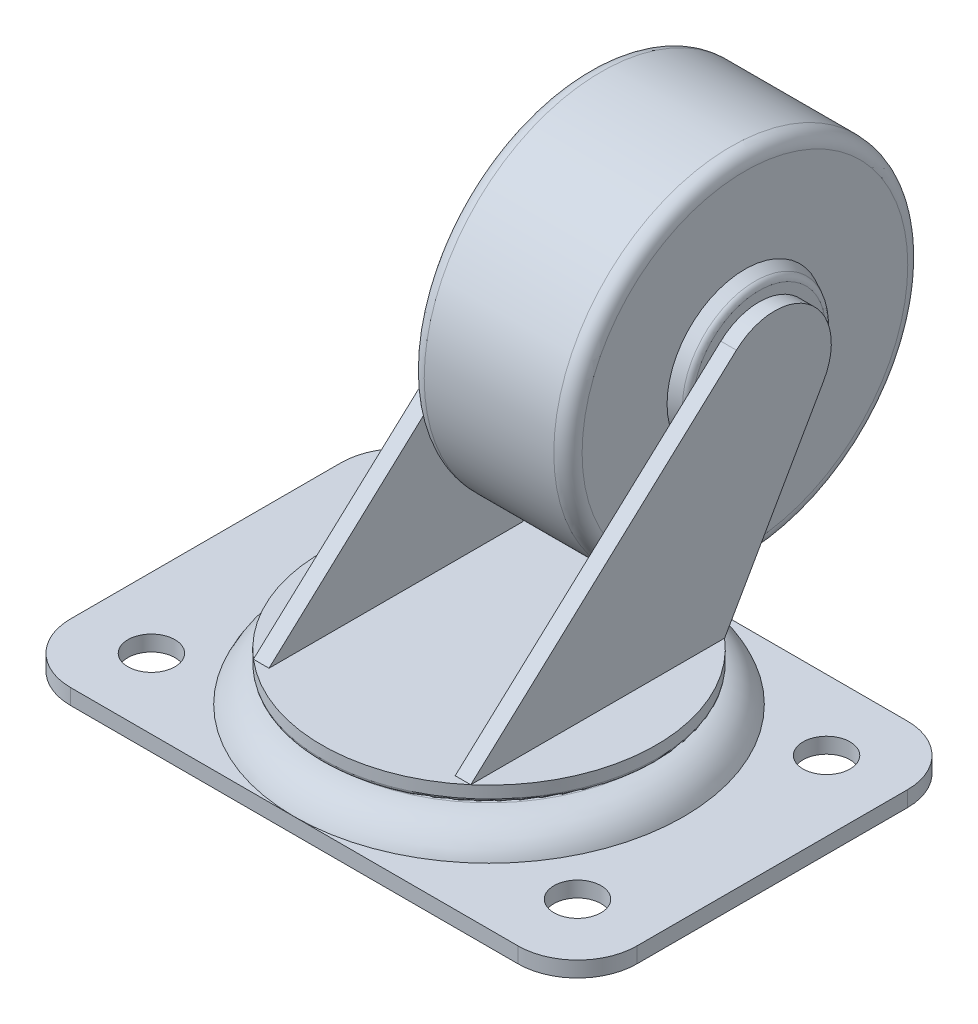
ISO-10303-21;
HEADER;
FILE_DESCRIPTION(('STEP AP214'),'2;1');
FILE_NAME('part.step','',(''),(''),'','','');
FILE_SCHEMA(('AUTOMOTIVE_DESIGN { 1 0 10303 214 1 1 1 1 }'));
ENDSEC;
DATA;
#1=APPLICATION_CONTEXT('core data for automotive mechanical design processes');
#2=APPLICATION_PROTOCOL_DEFINITION('international standard','automotive_design',2000,#1);
#3=PRODUCT_CONTEXT('',#1,'mechanical');
#4=PRODUCT('Part','Part','',(#3));
#5=PRODUCT_RELATED_PRODUCT_CATEGORY('part','',(#4));
#6=PRODUCT_DEFINITION_FORMATION('','',#4);
#7=PRODUCT_DEFINITION_CONTEXT('part definition',#1,'design');
#8=PRODUCT_DEFINITION('design','',#6,#7);
#9=PRODUCT_DEFINITION_SHAPE('','',#8);
#10=(LENGTH_UNIT() NAMED_UNIT(*) SI_UNIT(.MILLI.,.METRE.));
#11=(NAMED_UNIT(*) PLANE_ANGLE_UNIT() SI_UNIT($,.RADIAN.));
#12=(NAMED_UNIT(*) SI_UNIT($,.STERADIAN.) SOLID_ANGLE_UNIT());
#13=UNCERTAINTY_MEASURE_WITH_UNIT(LENGTH_MEASURE(1.E-05),#10,'distance_accuracy_value','');
#14=(GEOMETRIC_REPRESENTATION_CONTEXT(3) GLOBAL_UNCERTAINTY_ASSIGNED_CONTEXT((#13)) GLOBAL_UNIT_ASSIGNED_CONTEXT((#10,
#11,#12)) REPRESENTATION_CONTEXT('',''));
#15=CARTESIAN_POINT('',(0.,0.,0.));
#16=DIRECTION('',(0.,0.,1.));
#17=DIRECTION('',(1.,0.,0.));
#18=AXIS2_PLACEMENT_3D('',#15,#16,#17);
#19=CARTESIAN_POINT('',(16.7004999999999,47.625,-31.7500000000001));
#20=DIRECTION('',(-1.,0.,0.));
#21=DIRECTION('',(0.,0.,1.));
#22=AXIS2_PLACEMENT_3D('',#19,#20,#21);
#23=PLANE('',#22);
#24=DIRECTION('',(0.,0.675765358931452,-0.737116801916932));
#25=VECTOR('',#24,1.);
#26=CARTESIAN_POINT('',(16.7004999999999,55.114106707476,-24.8842239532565));
#27=LINE('',#26,#25);
#28=CARTESIAN_POINT('',(16.7005000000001,11.43,22.7658791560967));
#29=VERTEX_POINT('',#28);
#30=CARTESIAN_POINT('',(16.7004999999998,50.9078306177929,-20.296068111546));
#31=VERTEX_POINT('',#30);
#32=EDGE_CURVE('E244',#29,#31,#27,.T.);
#33=ORIENTED_EDGE('',*,*,#32,.T.);
#34=CARTESIAN_POINT('',(16.7004999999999,47.625,-31.7499999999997));
#35=DIRECTION('',(-1.,0.,0.));
#36=DIRECTION('',(0.,0.,1.));
#37=AXIS2_PLACEMENT_3D('',#34,#35,#36);
#38=CIRCLE('',#37,11.9150968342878);
#39=CARTESIAN_POINT('',(16.7004999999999,37.1794578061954,-37.4823800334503));
#40=VERTEX_POINT('',#39);
#41=EDGE_CURVE('E189',#31,#40,#38,.F.);
#42=ORIENTED_EDGE('',*,*,#41,.T.);
#43=DIRECTION('',(0.,-0.86820646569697,0.496203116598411));
#44=VECTOR('',#43,1.);
#45=CARTESIAN_POINT('',(16.7004999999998,42.5835763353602,-40.570977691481));
#46=LINE('',#45,#44);
#47=CARTESIAN_POINT('',(16.7004999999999,11.43,-22.7658791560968));
#48=VERTEX_POINT('',#47);
#49=EDGE_CURVE('E237',#40,#48,#46,.T.);
#50=ORIENTED_EDGE('',*,*,#49,.T.);
#51=DIRECTION('',(0.,0.,1.));
#52=VECTOR('',#51,1.);
#53=CARTESIAN_POINT('',(16.7005000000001,11.43,22.7658791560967));
#54=LINE('',#53,#52);
#55=EDGE_CURVE('E241',#48,#29,#54,.T.);
#56=ORIENTED_EDGE('',*,*,#55,.T.);
#57=EDGE_LOOP('',(#33,#42,#50,#56));
#58=FACE_BOUND('',#57,.T.);
#59=ADVANCED_FACE('F36',(#58),#23,.T.);
#60=CARTESIAN_POINT('',(-29.972,11.43,0.));
#61=DIRECTION('',(0.,1.,0.));
#62=DIRECTION('',(-1.,0.,0.));
#63=AXIS2_PLACEMENT_3D('',#60,#61,#62);
#64=PLANE('',#63);
#65=CARTESIAN_POINT('',(0.,11.43,0.));
#66=DIRECTION('',(0.,1.,0.));
#67=DIRECTION('',(-1.,0.,0.));
#68=AXIS2_PLACEMENT_3D('',#65,#66,#67);
#69=CIRCLE('',#68,29.972);
#70=CARTESIAN_POINT('',(-19.4945000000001,11.43,-22.7658791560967));
#71=VERTEX_POINT('',#70);
#72=CARTESIAN_POINT('',(-19.4944999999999,11.43,22.7658791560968));
#73=VERTEX_POINT('',#72);
#74=EDGE_CURVE('E576',#71,#73,#69,.T.);
#75=ORIENTED_EDGE('',*,*,#74,.T.);
#76=DIRECTION('',(0.,0.,1.));
#77=VECTOR('',#76,1.);
#78=CARTESIAN_POINT('',(-19.4944999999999,11.43,22.7658791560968));
#79=LINE('',#78,#77);
#80=EDGE_CURVE('E222',#71,#73,#79,.T.);
#81=ORIENTED_EDGE('',*,*,#80,.F.);
#82=EDGE_LOOP('',(#75,#81));
#83=FACE_BOUND('',#82,.T.);
#84=ADVANCED_FACE('F400',(#83),#64,.T.);
#85=CARTESIAN_POINT('',(19.4945000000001,11.43,22.7658791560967));
#86=VERTEX_POINT('',#85);
#87=CARTESIAN_POINT('',(19.4944999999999,11.43,-22.7658791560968));
#88=VERTEX_POINT('',#87);
#89=EDGE_CURVE('E269',#86,#88,#69,.T.);
#90=ORIENTED_EDGE('',*,*,#89,.T.);
#91=DIRECTION('',(0.,0.,1.));
#92=VECTOR('',#91,1.);
#93=CARTESIAN_POINT('',(19.4945000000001,11.43,22.7658791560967));
#94=LINE('',#93,#92);
#95=EDGE_CURVE('E253',#88,#86,#94,.T.);
#96=ORIENTED_EDGE('',*,*,#95,.T.);
#97=EDGE_LOOP('',(#90,#96));
#98=FACE_BOUND('',#97,.T.);
#99=ADVANCED_FACE('F406',(#98),#64,.T.);
#100=CARTESIAN_POINT('',(-40.132,2.794,24.257));
#101=DIRECTION('',(0.,1.,0.));
#102=DIRECTION('',(0.,0.,1.));
#103=AXIS2_PLACEMENT_3D('',#100,#101,#102);
#104=PLANE('',#103);
#105=CARTESIAN_POINT('',(-38.2143,2.794,-22.3393));
#106=DIRECTION('',(0.,1.,0.));
#107=DIRECTION('',(0.,0.,1.));
#108=AXIS2_PLACEMENT_3D('',#105,#106,#107);
#109=CIRCLE('',#108,4.2164);
#110=CARTESIAN_POINT('',(-38.2143,2.794,-18.1229));
#111=VERTEX_POINT('',#110);
#112=EDGE_CURVE('E299',#111,#111,#109,.T.);
#113=ORIENTED_EDGE('',*,*,#112,.F.);
#114=EDGE_LOOP('',(#113));
#115=FACE_BOUND('',#114,.T.);
#116=CARTESIAN_POINT('',(-38.2143,2.794,22.3393));
#117=DIRECTION('',(0.,1.,0.));
#118=DIRECTION('',(0.,0.,1.));
#119=AXIS2_PLACEMENT_3D('',#116,#117,#118);
#120=CIRCLE('',#119,4.2164);
#121=CARTESIAN_POINT('',(-38.2143,2.794,26.5557));
#122=VERTEX_POINT('',#121);
#123=EDGE_CURVE('E293',#122,#122,#120,.T.);
#124=ORIENTED_EDGE('',*,*,#123,.F.);
#125=EDGE_LOOP('',(#124));
#126=FACE_BOUND('',#125,.T.);
#127=DIRECTION('',(1.,0.,0.));
#128=VECTOR('',#127,1.);
#129=CARTESIAN_POINT('',(-40.132,2.794,34.925));
#130=LINE('',#129,#128);
#131=CARTESIAN_POINT('',(-40.132,2.794,34.925));
#132=VERTEX_POINT('',#131);
#133=CARTESIAN_POINT('',(0.,2.794,34.925));
#134=VERTEX_POINT('',#133);
#135=EDGE_CURVE('E316',#132,#134,#130,.T.);
#136=ORIENTED_EDGE('',*,*,#135,.T.);
#137=CARTESIAN_POINT('',(0.,2.794,0.));
#138=DIRECTION('',(0.,-1.,0.));
#139=DIRECTION('',(0.,0.,-1.));
#140=AXIS2_PLACEMENT_3D('',#137,#138,#139);
#141=CIRCLE('',#140,34.925);
#142=CARTESIAN_POINT('',(0.,2.794,-34.925));
#143=VERTEX_POINT('',#142);
#144=EDGE_CURVE('E279',#134,#143,#141,.T.);
#145=ORIENTED_EDGE('',*,*,#144,.T.);
#146=DIRECTION('',(-1.,0.,0.));
#147=VECTOR('',#146,1.);
#148=CARTESIAN_POINT('',(-40.132,2.794,-34.925));
#149=LINE('',#148,#147);
#150=CARTESIAN_POINT('',(-40.132,2.794,-34.925));
#151=VERTEX_POINT('',#150);
#152=EDGE_CURVE('E325',#143,#151,#149,.T.);
#153=ORIENTED_EDGE('',*,*,#152,.T.);
#154=CARTESIAN_POINT('',(-40.132,2.794,-24.257));
#155=DIRECTION('',(0.,1.,0.));
#156=DIRECTION('',(0.,0.,1.));
#157=AXIS2_PLACEMENT_3D('',#154,#155,#156);
#158=CIRCLE('',#157,10.668);
#159=CARTESIAN_POINT('',(-50.8,2.794,-24.257));
#160=VERTEX_POINT('',#159);
#161=EDGE_CURVE('E329',#151,#160,#158,.T.);
#162=ORIENTED_EDGE('',*,*,#161,.T.);
#163=DIRECTION('',(0.,0.,1.));
#164=VECTOR('',#163,1.);
#165=CARTESIAN_POINT('',(-50.8,2.794,-24.257));
#166=LINE('',#165,#164);
#167=CARTESIAN_POINT('',(-50.8,2.794,24.257));
#168=VERTEX_POINT('',#167);
#169=EDGE_CURVE('E331',#160,#168,#166,.T.);
#170=ORIENTED_EDGE('',*,*,#169,.T.);
#171=CARTESIAN_POINT('',(-40.132,2.794,24.257));
#172=DIRECTION('',(0.,1.,0.));
#173=DIRECTION('',(0.,0.,1.));
#174=AXIS2_PLACEMENT_3D('',#171,#172,#173);
#175=CIRCLE('',#174,10.668);
#176=EDGE_CURVE('E311',#168,#132,#175,.T.);
#177=ORIENTED_EDGE('',*,*,#176,.T.);
#178=EDGE_LOOP('',(#136,#145,#153,#162,#170,#177));
#179=FACE_BOUND('',#178,.T.);
#180=ADVANCED_FACE('F467',(#115,#126,#179),#104,.T.);
#181=CARTESIAN_POINT('',(38.2143,2.794,22.3393));
#182=DIRECTION('',(0.,1.,0.));
#183=DIRECTION('',(0.,0.,1.));
#184=AXIS2_PLACEMENT_3D('',#181,#182,#183);
#185=CIRCLE('',#184,4.2164);
#186=CARTESIAN_POINT('',(38.2143,2.794,26.5557));
#187=VERTEX_POINT('',#186);
#188=EDGE_CURVE('E287',#187,#187,#185,.T.);
#189=ORIENTED_EDGE('',*,*,#188,.F.);
#190=EDGE_LOOP('',(#189));
#191=FACE_BOUND('',#190,.T.);
#192=CARTESIAN_POINT('',(38.2143,2.794,-22.3393));
#193=DIRECTION('',(0.,1.,0.));
#194=DIRECTION('',(0.,0.,1.));
#195=AXIS2_PLACEMENT_3D('',#192,#193,#194);
#196=CIRCLE('',#195,4.2164);
#197=CARTESIAN_POINT('',(38.2143,2.794,-18.1229));
#198=VERTEX_POINT('',#197);
#199=EDGE_CURVE('E305',#198,#198,#196,.T.);
#200=ORIENTED_EDGE('',*,*,#199,.F.);
#201=EDGE_LOOP('',(#200));
#202=FACE_BOUND('',#201,.T.);
#203=CARTESIAN_POINT('',(40.132,2.794,-34.925));
#204=VERTEX_POINT('',#203);
#205=EDGE_CURVE('E326',#204,#143,#149,.T.);
#206=ORIENTED_EDGE('',*,*,#205,.T.);
#207=EDGE_CURVE('E280',#143,#134,#141,.T.);
#208=ORIENTED_EDGE('',*,*,#207,.T.);
#209=CARTESIAN_POINT('',(40.132,2.794,34.925));
#210=VERTEX_POINT('',#209);
#211=EDGE_CURVE('E314',#134,#210,#130,.T.);
#212=ORIENTED_EDGE('',*,*,#211,.T.);
#213=CARTESIAN_POINT('',(40.132,2.794,24.257));
#214=DIRECTION('',(0.,1.,0.));
#215=DIRECTION('',(0.,0.,1.));
#216=AXIS2_PLACEMENT_3D('',#213,#214,#215);
#217=CIRCLE('',#216,10.668);
#218=CARTESIAN_POINT('',(50.8,2.794,24.257));
#219=VERTEX_POINT('',#218);
#220=EDGE_CURVE('E319',#210,#219,#217,.T.);
#221=ORIENTED_EDGE('',*,*,#220,.T.);
#222=DIRECTION('',(0.,0.,-1.));
#223=VECTOR('',#222,1.);
#224=CARTESIAN_POINT('',(50.8,2.794,-24.257));
#225=LINE('',#224,#223);
#226=CARTESIAN_POINT('',(50.8,2.794,-24.257));
#227=VERTEX_POINT('',#226);
#228=EDGE_CURVE('E321',#219,#227,#225,.T.);
#229=ORIENTED_EDGE('',*,*,#228,.T.);
#230=CARTESIAN_POINT('',(40.132,2.794,-24.257));
#231=DIRECTION('',(0.,1.,0.));
#232=DIRECTION('',(0.,0.,-1.));
#233=AXIS2_PLACEMENT_3D('',#230,#231,#232);
#234=CIRCLE('',#233,10.668);
#235=EDGE_CURVE('E323',#227,#204,#234,.T.);
#236=ORIENTED_EDGE('',*,*,#235,.T.);
#237=EDGE_LOOP('',(#206,#208,#212,#221,#229,#236));
#238=FACE_BOUND('',#237,.T.);
#239=ADVANCED_FACE('F470',(#191,#202,#238),#104,.T.);
#240=CARTESIAN_POINT('',(-40.132,0.,24.257));
#241=DIRECTION('',(0.,1.,0.));
#242=DIRECTION('',(0.,0.,1.));
#243=AXIS2_PLACEMENT_3D('',#240,#241,#242);
#244=PLANE('',#243);
#245=CARTESIAN_POINT('',(-38.2143,0.,22.3393));
#246=DIRECTION('',(0.,1.,0.));
#247=DIRECTION('',(0.,0.,1.));
#248=AXIS2_PLACEMENT_3D('',#245,#246,#247);
#249=CIRCLE('',#248,4.2164);
#250=CARTESIAN_POINT('',(-38.2143,0.,26.5557));
#251=VERTEX_POINT('',#250);
#252=EDGE_CURVE('E290',#251,#251,#249,.T.);
#253=ORIENTED_EDGE('',*,*,#252,.T.);
#254=EDGE_LOOP('',(#253));
#255=FACE_BOUND('',#254,.T.);
#256=CARTESIAN_POINT('',(38.2143,0.,-22.3393));
#257=DIRECTION('',(0.,1.,0.));
#258=DIRECTION('',(0.,0.,1.));
#259=AXIS2_PLACEMENT_3D('',#256,#257,#258);
#260=CIRCLE('',#259,4.2164);
#261=CARTESIAN_POINT('',(38.2143,0.,-18.1229));
#262=VERTEX_POINT('',#261);
#263=EDGE_CURVE('E302',#262,#262,#260,.T.);
#264=ORIENTED_EDGE('',*,*,#263,.T.);
#265=EDGE_LOOP('',(#264));
#266=FACE_BOUND('',#265,.T.);
#267=CARTESIAN_POINT('',(-40.132,0.,24.257));
#268=DIRECTION('',(0.,1.,0.));
#269=DIRECTION('',(0.,0.,1.));
#270=AXIS2_PLACEMENT_3D('',#267,#268,#269);
#271=CIRCLE('',#270,10.668);
#272=CARTESIAN_POINT('',(-50.8,0.,24.257));
#273=VERTEX_POINT('',#272);
#274=CARTESIAN_POINT('',(-40.132,0.,34.925));
#275=VERTEX_POINT('',#274);
#276=EDGE_CURVE('E308',#273,#275,#271,.T.);
#277=ORIENTED_EDGE('',*,*,#276,.F.);
#278=DIRECTION('',(0.,0.,1.));
#279=VECTOR('',#278,1.);
#280=CARTESIAN_POINT('',(-50.8,0.,-24.257));
#281=LINE('',#280,#279);
#282=CARTESIAN_POINT('',(-50.8,0.,-24.257));
#283=VERTEX_POINT('',#282);
#284=EDGE_CURVE('E315',#283,#273,#281,.T.);
#285=ORIENTED_EDGE('',*,*,#284,.F.);
#286=CARTESIAN_POINT('',(-40.132,0.,-24.257));
#287=DIRECTION('',(0.,1.,0.));
#288=DIRECTION('',(0.,0.,1.));
#289=AXIS2_PLACEMENT_3D('',#286,#287,#288);
#290=CIRCLE('',#289,10.668);
#291=CARTESIAN_POINT('',(-40.132,0.,-34.925));
#292=VERTEX_POINT('',#291);
#293=EDGE_CURVE('E346',#292,#283,#290,.T.);
#294=ORIENTED_EDGE('',*,*,#293,.F.);
#295=DIRECTION('',(-1.,0.,0.));
#296=VECTOR('',#295,1.);
#297=CARTESIAN_POINT('',(-40.132,0.,-34.925));
#298=LINE('',#297,#296);
#299=CARTESIAN_POINT('',(40.132,0.,-34.925));
#300=VERTEX_POINT('',#299);
#301=EDGE_CURVE('E344',#300,#292,#298,.T.);
#302=ORIENTED_EDGE('',*,*,#301,.F.);
#303=CARTESIAN_POINT('',(40.132,0.,-24.257));
#304=DIRECTION('',(0.,1.,0.));
#305=DIRECTION('',(0.,0.,-1.));
#306=AXIS2_PLACEMENT_3D('',#303,#304,#305);
#307=CIRCLE('',#306,10.668);
#308=CARTESIAN_POINT('',(50.8,0.,-24.257));
#309=VERTEX_POINT('',#308);
#310=EDGE_CURVE('E342',#309,#300,#307,.T.);
#311=ORIENTED_EDGE('',*,*,#310,.F.);
#312=DIRECTION('',(0.,0.,-1.));
#313=VECTOR('',#312,1.);
#314=CARTESIAN_POINT('',(50.8,0.,-24.257));
#315=LINE('',#314,#313);
#316=CARTESIAN_POINT('',(50.8,0.,24.257));
#317=VERTEX_POINT('',#316);
#318=EDGE_CURVE('E340',#317,#309,#315,.T.);
#319=ORIENTED_EDGE('',*,*,#318,.F.);
#320=CARTESIAN_POINT('',(40.132,0.,24.257));
#321=DIRECTION('',(0.,1.,0.));
#322=DIRECTION('',(0.,0.,1.));
#323=AXIS2_PLACEMENT_3D('',#320,#321,#322);
#324=CIRCLE('',#323,10.668);
#325=CARTESIAN_POINT('',(40.132,0.,34.925));
#326=VERTEX_POINT('',#325);
#327=EDGE_CURVE('E338',#326,#317,#324,.T.);
#328=ORIENTED_EDGE('',*,*,#327,.F.);
#329=DIRECTION('',(1.,0.,0.));
#330=VECTOR('',#329,1.);
#331=CARTESIAN_POINT('',(-40.132,0.,34.925));
#332=LINE('',#331,#330);
#333=EDGE_CURVE('E336',#275,#326,#332,.T.);
#334=ORIENTED_EDGE('',*,*,#333,.F.);
#335=EDGE_LOOP('',(#277,#285,#294,#302,#311,#319,#328,#334));
#336=FACE_BOUND('',#335,.T.);
#337=CARTESIAN_POINT('',(-38.2143,0.,-22.3393));
#338=DIRECTION('',(0.,1.,0.));
#339=DIRECTION('',(0.,0.,1.));
#340=AXIS2_PLACEMENT_3D('',#337,#338,#339);
#341=CIRCLE('',#340,4.2164);
#342=CARTESIAN_POINT('',(-38.2143,0.,-18.1229));
#343=VERTEX_POINT('',#342);
#344=EDGE_CURVE('E296',#343,#343,#341,.T.);
#345=ORIENTED_EDGE('',*,*,#344,.T.);
#346=EDGE_LOOP('',(#345));
#347=FACE_BOUND('',#346,.T.);
#348=CARTESIAN_POINT('',(38.2143,0.,22.3393));
#349=DIRECTION('',(0.,1.,0.));
#350=DIRECTION('',(0.,0.,1.));
#351=AXIS2_PLACEMENT_3D('',#348,#349,#350);
#352=CIRCLE('',#351,4.2164);
#353=CARTESIAN_POINT('',(38.2143,0.,26.5557));
#354=VERTEX_POINT('',#353);
#355=EDGE_CURVE('E286',#354,#354,#352,.T.);
#356=ORIENTED_EDGE('',*,*,#355,.T.);
#357=EDGE_LOOP('',(#356));
#358=FACE_BOUND('',#357,.T.);
#359=ADVANCED_FACE('F472',(#255,#266,#336,#347,#358),#244,.F.);
#360=CARTESIAN_POINT('',(-40.132,2.794,24.257));
#361=DIRECTION('',(0.,-1.,0.));
#362=DIRECTION('',(0.,0.,-1.));
#363=AXIS2_PLACEMENT_3D('',#360,#361,#362);
#364=CYLINDRICAL_SURFACE('',#363,10.668);
#365=ORIENTED_EDGE('',*,*,#276,.T.);
#366=DIRECTION('',(0.,-1.,0.));
#367=VECTOR('',#366,1.);
#368=CARTESIAN_POINT('',(-40.132,2.794,34.925));
#369=LINE('',#368,#367);
#370=EDGE_CURVE('E190',#132,#275,#369,.T.);
#371=ORIENTED_EDGE('',*,*,#370,.F.);
#372=ORIENTED_EDGE('',*,*,#176,.F.);
#373=DIRECTION('',(0.,-1.,0.));
#374=VECTOR('',#373,1.);
#375=CARTESIAN_POINT('',(-50.8,2.794,24.257));
#376=LINE('',#375,#374);
#377=EDGE_CURVE('E333',#168,#273,#376,.T.);
#378=ORIENTED_EDGE('',*,*,#377,.T.);
#379=EDGE_LOOP('',(#365,#371,#372,#378));
#380=FACE_BOUND('',#379,.T.);
#381=ADVANCED_FACE('F475',(#380),#364,.T.);
#382=CARTESIAN_POINT('',(-40.132,2.794,34.925));
#383=DIRECTION('',(0.,0.,-1.));
#384=DIRECTION('',(-1.,0.,0.));
#385=AXIS2_PLACEMENT_3D('',#382,#383,#384);
#386=PLANE('',#385);
#387=ORIENTED_EDGE('',*,*,#333,.T.);
#388=DIRECTION('',(0.,-1.,0.));
#389=VECTOR('',#388,1.);
#390=CARTESIAN_POINT('',(40.132,2.794,34.925));
#391=LINE('',#390,#389);
#392=EDGE_CURVE('E366',#210,#326,#391,.T.);
#393=ORIENTED_EDGE('',*,*,#392,.F.);
#394=ORIENTED_EDGE('',*,*,#211,.F.);
#395=ORIENTED_EDGE('',*,*,#135,.F.);
#396=ORIENTED_EDGE('',*,*,#370,.T.);
#397=EDGE_LOOP('',(#387,#393,#394,#395,#396));
#398=FACE_BOUND('',#397,.T.);
#399=ADVANCED_FACE('F499',(#398),#386,.F.);
#400=CARTESIAN_POINT('',(40.132,2.794,24.257));
#401=DIRECTION('',(0.,-1.,0.));
#402=DIRECTION('',(0.,0.,-1.));
#403=AXIS2_PLACEMENT_3D('',#400,#401,#402);
#404=CYLINDRICAL_SURFACE('',#403,10.668);
#405=ORIENTED_EDGE('',*,*,#327,.T.);
#406=DIRECTION('',(0.,-1.,0.));
#407=VECTOR('',#406,1.);
#408=CARTESIAN_POINT('',(50.8,2.794,24.257));
#409=LINE('',#408,#407);
#410=EDGE_CURVE('E363',#219,#317,#409,.T.);
#411=ORIENTED_EDGE('',*,*,#410,.F.);
#412=ORIENTED_EDGE('',*,*,#220,.F.);
#413=ORIENTED_EDGE('',*,*,#392,.T.);
#414=EDGE_LOOP('',(#405,#411,#412,#413));
#415=FACE_BOUND('',#414,.T.);
#416=ADVANCED_FACE('F495',(#415),#404,.T.);
#417=CARTESIAN_POINT('',(50.8,2.794,-24.257));
#418=DIRECTION('',(-1.,0.,0.));
#419=DIRECTION('',(0.,0.,1.));
#420=AXIS2_PLACEMENT_3D('',#417,#418,#419);
#421=PLANE('',#420);
#422=ORIENTED_EDGE('',*,*,#318,.T.);
#423=DIRECTION('',(0.,-1.,0.));
#424=VECTOR('',#423,1.);
#425=CARTESIAN_POINT('',(50.8,2.794,-24.257));
#426=LINE('',#425,#424);
#427=EDGE_CURVE('E360',#227,#309,#426,.T.);
#428=ORIENTED_EDGE('',*,*,#427,.F.);
#429=ORIENTED_EDGE('',*,*,#228,.F.);
#430=ORIENTED_EDGE('',*,*,#410,.T.);
#431=EDGE_LOOP('',(#422,#428,#429,#430));
#432=FACE_BOUND('',#431,.T.);
#433=ADVANCED_FACE('F491',(#432),#421,.F.);
#434=CARTESIAN_POINT('',(40.132,2.794,-24.257));
#435=DIRECTION('',(0.,-1.,0.));
#436=DIRECTION('',(0.,0.,-1.));
#437=AXIS2_PLACEMENT_3D('',#434,#435,#436);
#438=CYLINDRICAL_SURFACE('',#437,10.668);
#439=ORIENTED_EDGE('',*,*,#310,.T.);
#440=DIRECTION('',(0.,-1.,0.));
#441=VECTOR('',#440,1.);
#442=CARTESIAN_POINT('',(40.132,2.794,-34.925));
#443=LINE('',#442,#441);
#444=EDGE_CURVE('E357',#204,#300,#443,.T.);
#445=ORIENTED_EDGE('',*,*,#444,.F.);
#446=ORIENTED_EDGE('',*,*,#235,.F.);
#447=ORIENTED_EDGE('',*,*,#427,.T.);
#448=EDGE_LOOP('',(#439,#445,#446,#447));
#449=FACE_BOUND('',#448,.T.);
#450=ADVANCED_FACE('F487',(#449),#438,.T.);
#451=CARTESIAN_POINT('',(-40.132,2.794,-34.925));
#452=DIRECTION('',(0.,0.,1.));
#453=DIRECTION('',(1.,0.,0.));
#454=AXIS2_PLACEMENT_3D('',#451,#452,#453);
#455=PLANE('',#454);
#456=ORIENTED_EDGE('',*,*,#301,.T.);
#457=DIRECTION('',(0.,-1.,0.));
#458=VECTOR('',#457,1.);
#459=CARTESIAN_POINT('',(-40.132,2.794,-34.925));
#460=LINE('',#459,#458);
#461=EDGE_CURVE('E354',#151,#292,#460,.T.);
#462=ORIENTED_EDGE('',*,*,#461,.F.);
#463=ORIENTED_EDGE('',*,*,#152,.F.);
#464=ORIENTED_EDGE('',*,*,#205,.F.);
#465=ORIENTED_EDGE('',*,*,#444,.T.);
#466=EDGE_LOOP('',(#456,#462,#463,#464,#465));
#467=FACE_BOUND('',#466,.T.);
#468=ADVANCED_FACE('F483',(#467),#455,.F.);
#469=CARTESIAN_POINT('',(-40.132,2.794,-24.257));
#470=DIRECTION('',(0.,-1.,0.));
#471=DIRECTION('',(0.,0.,-1.));
#472=AXIS2_PLACEMENT_3D('',#469,#470,#471);
#473=CYLINDRICAL_SURFACE('',#472,10.668);
#474=ORIENTED_EDGE('',*,*,#293,.T.);
#475=DIRECTION('',(0.,-1.,0.));
#476=VECTOR('',#475,1.);
#477=CARTESIAN_POINT('',(-50.8,2.794,-24.257));
#478=LINE('',#477,#476);
#479=EDGE_CURVE('E351',#160,#283,#478,.T.);
#480=ORIENTED_EDGE('',*,*,#479,.F.);
#481=ORIENTED_EDGE('',*,*,#161,.F.);
#482=ORIENTED_EDGE('',*,*,#461,.T.);
#483=EDGE_LOOP('',(#474,#480,#481,#482));
#484=FACE_BOUND('',#483,.T.);
#485=ADVANCED_FACE('F479',(#484),#473,.T.);
#486=CARTESIAN_POINT('',(-50.8,2.794,-24.257));
#487=DIRECTION('',(1.,0.,0.));
#488=DIRECTION('',(0.,0.,-1.));
#489=AXIS2_PLACEMENT_3D('',#486,#487,#488);
#490=PLANE('',#489);
#491=ORIENTED_EDGE('',*,*,#284,.T.);
#492=ORIENTED_EDGE('',*,*,#377,.F.);
#493=ORIENTED_EDGE('',*,*,#169,.F.);
#494=ORIENTED_EDGE('',*,*,#479,.T.);
#495=EDGE_LOOP('',(#491,#492,#493,#494));
#496=FACE_BOUND('',#495,.T.);
#497=ADVANCED_FACE('F465',(#496),#490,.F.);
#498=CARTESIAN_POINT('',(38.2143,2.794,-22.3393));
#499=DIRECTION('',(0.,-1.,0.));
#500=DIRECTION('',(0.,0.,-1.));
#501=AXIS2_PLACEMENT_3D('',#498,#499,#500);
#502=CYLINDRICAL_SURFACE('',#501,4.2164);
#503=ORIENTED_EDGE('',*,*,#199,.T.);
#504=EDGE_LOOP('',(#503));
#505=FACE_BOUND('',#504,.T.);
#506=ORIENTED_EDGE('',*,*,#263,.F.);
#507=EDGE_LOOP('',(#506));
#508=FACE_BOUND('',#507,.T.);
#509=ADVANCED_FACE('F461',(#505,#508),#502,.F.);
#510=CARTESIAN_POINT('',(-38.2143,2.794,-22.3393));
#511=DIRECTION('',(0.,-1.,0.));
#512=DIRECTION('',(0.,0.,-1.));
#513=AXIS2_PLACEMENT_3D('',#510,#511,#512);
#514=CYLINDRICAL_SURFACE('',#513,4.2164);
#515=ORIENTED_EDGE('',*,*,#112,.T.);
#516=EDGE_LOOP('',(#515));
#517=FACE_BOUND('',#516,.T.);
#518=ORIENTED_EDGE('',*,*,#344,.F.);
#519=EDGE_LOOP('',(#518));
#520=FACE_BOUND('',#519,.T.);
#521=ADVANCED_FACE('F457',(#517,#520),#514,.F.);
#522=CARTESIAN_POINT('',(-38.2143,2.794,22.3393));
#523=DIRECTION('',(0.,-1.,0.));
#524=DIRECTION('',(0.,0.,-1.));
#525=AXIS2_PLACEMENT_3D('',#522,#523,#524);
#526=CYLINDRICAL_SURFACE('',#525,4.2164);
#527=ORIENTED_EDGE('',*,*,#123,.T.);
#528=EDGE_LOOP('',(#527));
#529=FACE_BOUND('',#528,.T.);
#530=ORIENTED_EDGE('',*,*,#252,.F.);
#531=EDGE_LOOP('',(#530));
#532=FACE_BOUND('',#531,.T.);
#533=ADVANCED_FACE('F453',(#529,#532),#526,.F.);
#534=CARTESIAN_POINT('',(38.2143,2.794,22.3393));
#535=DIRECTION('',(0.,-1.,0.));
#536=DIRECTION('',(0.,0.,-1.));
#537=AXIS2_PLACEMENT_3D('',#534,#535,#536);
#538=CYLINDRICAL_SURFACE('',#537,4.2164);
#539=ORIENTED_EDGE('',*,*,#188,.T.);
#540=EDGE_LOOP('',(#539));
#541=FACE_BOUND('',#540,.T.);
#542=ORIENTED_EDGE('',*,*,#355,.F.);
#543=EDGE_LOOP('',(#542));
#544=FACE_BOUND('',#543,.T.);
#545=ADVANCED_FACE('F449',(#541,#544),#538,.F.);
#546=CARTESIAN_POINT('',(0.,7.366,0.));
#547=DIRECTION('',(0.,-1.,0.));
#548=DIRECTION('',(0.,0.,-1.));
#549=AXIS2_PLACEMENT_3D('',#546,#547,#548);
#550=PLANE('',#549);
#551=CARTESIAN_POINT('',(0.,7.366,0.));
#552=DIRECTION('',(0.,1.,0.));
#553=DIRECTION('',(-1.,0.,0.));
#554=AXIS2_PLACEMENT_3D('',#551,#552,#553);
#555=CIRCLE('',#554,6.35);
#556=CARTESIAN_POINT('',(-6.35,7.366,0.));
#557=VERTEX_POINT('',#556);
#558=EDGE_CURVE('E276',#557,#557,#555,.T.);
#559=ORIENTED_EDGE('',*,*,#558,.F.);
#560=EDGE_LOOP('',(#559));
#561=FACE_BOUND('',#560,.T.);
#562=CARTESIAN_POINT('',(0.,7.36599999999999,0.));
#563=DIRECTION('',(0.,-1.,0.));
#564=DIRECTION('',(0.,0.,-1.));
#565=AXIS2_PLACEMENT_3D('',#562,#563,#564);
#566=CIRCLE('',#565,28.1094648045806);
#567=CARTESIAN_POINT('',(0.,7.36599999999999,-28.1094648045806));
#568=VERTEX_POINT('',#567);
#569=EDGE_CURVE('E283',#568,#568,#566,.T.);
#570=ORIENTED_EDGE('',*,*,#569,.F.);
#571=EDGE_LOOP('',(#570));
#572=FACE_BOUND('',#571,.T.);
#573=ADVANCED_FACE('F445',(#561,#572),#550,.F.);
#574=CARTESIAN_POINT('',(0.,0.,0.));
#575=DIRECTION('',(0.,-1.,0.));
#576=DIRECTION('',(0.,0.,-1.));
#577=AXIS2_PLACEMENT_3D('',#574,#575,#576);
#578=TOROIDAL_SURFACE('',#577,28.1094648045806,7.366);
#579=ORIENTED_EDGE('',*,*,#207,.F.);
#580=ORIENTED_EDGE('',*,*,#144,.F.);
#581=EDGE_LOOP('',(#579,#580));
#582=FACE_BOUND('',#581,.T.);
#583=ORIENTED_EDGE('',*,*,#569,.T.);
#584=EDGE_LOOP('',(#583));
#585=FACE_BOUND('',#584,.T.);
#586=ADVANCED_FACE('F441',(#582,#585),#578,.T.);
#587=CARTESIAN_POINT('',(0.,11.43,0.));
#588=DIRECTION('',(0.,1.,0.));
#589=DIRECTION('',(-1.,0.,0.));
#590=AXIS2_PLACEMENT_3D('',#587,#588,#589);
#591=CYLINDRICAL_SURFACE('',#590,6.35);
#592=ORIENTED_EDGE('',*,*,#558,.T.);
#593=EDGE_LOOP('',(#592));
#594=FACE_BOUND('',#593,.T.);
#595=CARTESIAN_POINT('',(0.,8.636,0.));
#596=DIRECTION('',(0.,1.,0.));
#597=DIRECTION('',(-1.,0.,0.));
#598=AXIS2_PLACEMENT_3D('',#595,#596,#597);
#599=CIRCLE('',#598,6.35);
#600=CARTESIAN_POINT('',(-6.35,8.636,0.));
#601=VERTEX_POINT('',#600);
#602=EDGE_CURVE('E272',#601,#601,#599,.T.);
#603=ORIENTED_EDGE('',*,*,#602,.F.);
#604=EDGE_LOOP('',(#603));
#605=FACE_BOUND('',#604,.T.);
#606=ADVANCED_FACE('F437',(#594,#605),#591,.T.);
#607=CARTESIAN_POINT('',(-6.35,8.636,0.));
#608=DIRECTION('',(0.,-1.,0.));
#609=DIRECTION('',(1.,0.,0.));
#610=AXIS2_PLACEMENT_3D('',#607,#608,#609);
#611=PLANE('',#610);
#612=CARTESIAN_POINT('',(0.,8.636,0.));
#613=DIRECTION('',(0.,-1.,0.));
#614=DIRECTION('',(1.,0.,0.));
#615=AXIS2_PLACEMENT_3D('',#612,#613,#614);
#616=CIRCLE('',#615,29.337);
#617=CARTESIAN_POINT('',(29.337,8.636,0.));
#618=VERTEX_POINT('',#617);
#619=EDGE_CURVE('E11',#618,#618,#616,.T.);
#620=ORIENTED_EDGE('',*,*,#619,.T.);
#621=EDGE_LOOP('',(#620));
#622=FACE_BOUND('',#621,.T.);
#623=ORIENTED_EDGE('',*,*,#602,.T.);
#624=EDGE_LOOP('',(#623));
#625=FACE_BOUND('',#624,.T.);
#626=ADVANCED_FACE('F434',(#622,#625),#611,.T.);
#627=CARTESIAN_POINT('',(0.,11.43,0.));
#628=DIRECTION('',(0.,1.,0.));
#629=DIRECTION('',(-1.,0.,0.));
#630=AXIS2_PLACEMENT_3D('',#627,#628,#629);
#631=CYLINDRICAL_SURFACE('',#630,29.972);
#632=CARTESIAN_POINT('',(0.,9.271,0.));
#633=DIRECTION('',(0.,-1.,0.));
#634=DIRECTION('',(1.,0.,0.));
#635=AXIS2_PLACEMENT_3D('',#632,#633,#634);
#636=CIRCLE('',#635,29.972);
#637=CARTESIAN_POINT('',(29.972,9.271,0.));
#638=VERTEX_POINT('',#637);
#639=EDGE_CURVE('E44',#638,#638,#636,.F.);
#640=ORIENTED_EDGE('',*,*,#639,.T.);
#641=EDGE_LOOP('',(#640));
#642=FACE_BOUND('',#641,.T.);
#643=ORIENTED_EDGE('',*,*,#89,.F.);
#644=EDGE_CURVE('E268',#73,#86,#69,.T.);
#645=ORIENTED_EDGE('',*,*,#644,.F.);
#646=ORIENTED_EDGE('',*,*,#74,.F.);
#647=EDGE_CURVE('E273',#88,#71,#69,.T.);
#648=ORIENTED_EDGE('',*,*,#647,.F.);
#649=EDGE_LOOP('',(#643,#645,#646,#648));
#650=FACE_BOUND('',#649,.T.);
#651=ADVANCED_FACE('F387',(#642,#650),#631,.T.);
#652=DIRECTION('',(0.,0.,1.));
#653=VECTOR('',#652,1.);
#654=CARTESIAN_POINT('',(-16.7004999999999,11.43,22.7658791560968));
#655=LINE('',#654,#653);
#656=CARTESIAN_POINT('',(-16.7005000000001,11.43,-22.7658791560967));
#657=VERTEX_POINT('',#656);
#658=CARTESIAN_POINT('',(-16.7004999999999,11.43,22.7658791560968));
#659=VERTEX_POINT('',#658);
#660=EDGE_CURVE('E182',#657,#659,#655,.T.);
#661=ORIENTED_EDGE('',*,*,#660,.T.);
#662=DIRECTION('',(-1.,0.,0.));
#663=VECTOR('',#662,1.);
#664=CARTESIAN_POINT('',(-16.7004999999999,11.43,22.7658791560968));
#665=LINE('',#664,#663);
#666=EDGE_CURVE('E229',#659,#73,#665,.T.);
#667=ORIENTED_EDGE('',*,*,#666,.T.);
#668=ORIENTED_EDGE('',*,*,#644,.T.);
#669=DIRECTION('',(1.,0.,0.));
#670=VECTOR('',#669,1.);
#671=CARTESIAN_POINT('',(16.7005000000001,11.43,22.7658791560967));
#672=LINE('',#671,#670);
#673=EDGE_CURVE('E259',#29,#86,#672,.T.);
#674=ORIENTED_EDGE('',*,*,#673,.F.);
#675=ORIENTED_EDGE('',*,*,#55,.F.);
#676=DIRECTION('',(1.,0.,0.));
#677=VECTOR('',#676,1.);
#678=CARTESIAN_POINT('',(16.7004999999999,11.43,-22.7658791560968));
#679=LINE('',#678,#677);
#680=EDGE_CURVE('E262',#48,#88,#679,.T.);
#681=ORIENTED_EDGE('',*,*,#680,.T.);
#682=ORIENTED_EDGE('',*,*,#647,.T.);
#683=DIRECTION('',(-1.,0.,0.));
#684=VECTOR('',#683,1.);
#685=CARTESIAN_POINT('',(-16.7005000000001,11.43,-22.7658791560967));
#686=LINE('',#685,#684);
#687=EDGE_CURVE('E227',#657,#71,#686,.T.);
#688=ORIENTED_EDGE('',*,*,#687,.F.);
#689=EDGE_LOOP('',(#661,#667,#668,#674,#675,#681,#682,#688));
#690=FACE_BOUND('',#689,.T.);
#691=ADVANCED_FACE('F409',(#690),#64,.T.);
#692=CARTESIAN_POINT('',(16.7004999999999,47.625,-31.7500000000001));
#693=DIRECTION('',(1.,0.,0.));
#694=DIRECTION('',(0.,0.,-1.));
#695=AXIS2_PLACEMENT_3D('',#692,#693,#694);
#696=CYLINDRICAL_SURFACE('',#695,10.1599999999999);
#697=CARTESIAN_POINT('',(19.4944999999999,47.625,-31.7500000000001));
#698=DIRECTION('',(-1.,0.,0.));
#699=DIRECTION('',(0.,0.,1.));
#700=AXIS2_PLACEMENT_3D('',#697,#698,#699);
#701=CIRCLE('',#700,10.1599999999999);
#702=CARTESIAN_POINT('',(19.4944999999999,55.114106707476,-24.8842239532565));
#703=VERTEX_POINT('',#702);
#704=CARTESIAN_POINT('',(19.4944999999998,42.5835763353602,-40.570977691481));
#705=VERTEX_POINT('',#704);
#706=EDGE_CURVE('E234',#703,#705,#701,.T.);
#707=ORIENTED_EDGE('',*,*,#706,.T.);
#708=DIRECTION('',(1.,0.,0.));
#709=VECTOR('',#708,1.);
#710=CARTESIAN_POINT('',(16.7004999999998,42.5835763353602,-40.570977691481));
#711=LINE('',#710,#709);
#712=CARTESIAN_POINT('',(16.7004999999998,42.5835763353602,-40.5709776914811));
#713=VERTEX_POINT('',#712);
#714=EDGE_CURVE('E265',#713,#705,#711,.T.);
#715=ORIENTED_EDGE('',*,*,#714,.F.);
#716=CARTESIAN_POINT('',(16.7004999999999,47.625,-31.7500000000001));
#717=DIRECTION('',(-1.,0.,0.));
#718=DIRECTION('',(0.,0.,1.));
#719=AXIS2_PLACEMENT_3D('',#716,#717,#718);
#720=CIRCLE('',#719,10.1599999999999);
#721=CARTESIAN_POINT('',(16.7004999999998,55.1141067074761,-24.8842239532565));
#722=VERTEX_POINT('',#721);
#723=EDGE_CURVE('E235',#722,#713,#720,.T.);
#724=ORIENTED_EDGE('',*,*,#723,.F.);
#725=DIRECTION('',(1.,0.,0.));
#726=VECTOR('',#725,1.);
#727=CARTESIAN_POINT('',(16.7004999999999,55.114106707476,-24.8842239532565));
#728=LINE('',#727,#726);
#729=EDGE_CURVE('E247',#722,#703,#728,.T.);
#730=ORIENTED_EDGE('',*,*,#729,.T.);
#731=EDGE_LOOP('',(#707,#715,#724,#730));
#732=FACE_BOUND('',#731,.T.);
#733=ADVANCED_FACE('F425',(#732),#696,.T.);
#734=CARTESIAN_POINT('',(16.7004999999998,42.5835763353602,-40.570977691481));
#735=DIRECTION('',(0.,0.496203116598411,0.86820646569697));
#736=DIRECTION('',(0.,-0.86820646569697,0.496203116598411));
#737=AXIS2_PLACEMENT_3D('',#734,#735,#736);
#738=PLANE('',#737);
#739=DIRECTION('',(0.,-0.86820646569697,0.496203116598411));
#740=VECTOR('',#739,1.);
#741=CARTESIAN_POINT('',(19.4944999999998,42.5835763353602,-40.570977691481));
#742=LINE('',#741,#740);
#743=EDGE_CURVE('E250',#705,#88,#742,.T.);
#744=ORIENTED_EDGE('',*,*,#743,.T.);
#745=ORIENTED_EDGE('',*,*,#680,.F.);
#746=ORIENTED_EDGE('',*,*,#49,.F.);
#747=EDGE_CURVE('E239',#713,#40,#46,.T.);
#748=ORIENTED_EDGE('',*,*,#747,.F.);
#749=ORIENTED_EDGE('',*,*,#714,.T.);
#750=EDGE_LOOP('',(#744,#745,#746,#748,#749));
#751=FACE_BOUND('',#750,.T.);
#752=ADVANCED_FACE('F421',(#751),#738,.F.);
#753=CARTESIAN_POINT('',(16.7004999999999,55.114106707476,-24.8842239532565));
#754=DIRECTION('',(0.,-0.737116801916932,-0.675765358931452));
#755=DIRECTION('',(0.,0.675765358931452,-0.737116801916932));
#756=AXIS2_PLACEMENT_3D('',#753,#754,#755);
#757=PLANE('',#756);
#758=DIRECTION('',(0.,0.675765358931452,-0.737116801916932));
#759=VECTOR('',#758,1.);
#760=CARTESIAN_POINT('',(19.4944999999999,55.114106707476,-24.8842239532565));
#761=LINE('',#760,#759);
#762=EDGE_CURVE('E238',#86,#703,#761,.T.);
#763=ORIENTED_EDGE('',*,*,#762,.T.);
#764=ORIENTED_EDGE('',*,*,#729,.F.);
#765=EDGE_CURVE('E243',#31,#722,#27,.T.);
#766=ORIENTED_EDGE('',*,*,#765,.F.);
#767=ORIENTED_EDGE('',*,*,#32,.F.);
#768=ORIENTED_EDGE('',*,*,#673,.T.);
#769=EDGE_LOOP('',(#763,#764,#766,#767,#768));
#770=FACE_BOUND('',#769,.T.);
#771=ADVANCED_FACE('F417',(#770),#757,.F.);
#772=CARTESIAN_POINT('',(19.4944999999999,47.625,-31.7500000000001));
#773=DIRECTION('',(-1.,0.,0.));
#774=DIRECTION('',(0.,0.,1.));
#775=AXIS2_PLACEMENT_3D('',#772,#773,#774);
#776=PLANE('',#775);
#777=ORIENTED_EDGE('',*,*,#706,.F.);
#778=ORIENTED_EDGE('',*,*,#762,.F.);
#779=ORIENTED_EDGE('',*,*,#95,.F.);
#780=ORIENTED_EDGE('',*,*,#743,.F.);
#781=EDGE_LOOP('',(#777,#778,#779,#780));
#782=FACE_BOUND('',#781,.T.);
#783=ADVANCED_FACE('F414',(#782),#776,.F.);
#784=CARTESIAN_POINT('',(-16.7005000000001,47.625,-31.7499999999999));
#785=DIRECTION('',(-1.,0.,0.));
#786=DIRECTION('',(0.,0.,1.));
#787=AXIS2_PLACEMENT_3D('',#784,#785,#786);
#788=CYLINDRICAL_SURFACE('',#787,10.1599999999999);
#789=CARTESIAN_POINT('',(-19.4945000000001,47.625,-31.7499999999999));
#790=DIRECTION('',(-1.,0.,0.));
#791=DIRECTION('',(0.,0.,1.));
#792=AXIS2_PLACEMENT_3D('',#789,#790,#791);
#793=CIRCLE('',#792,10.1599999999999);
#794=CARTESIAN_POINT('',(-19.4945000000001,55.114106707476,-24.8842239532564));
#795=VERTEX_POINT('',#794);
#796=CARTESIAN_POINT('',(-19.4945000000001,42.5835763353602,-40.5709776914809));
#797=VERTEX_POINT('',#796);
#798=EDGE_CURVE('E210',#795,#797,#793,.T.);
#799=ORIENTED_EDGE('',*,*,#798,.F.);
#800=DIRECTION('',(-1.,0.,0.));
#801=VECTOR('',#800,1.);
#802=CARTESIAN_POINT('',(-16.7005000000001,55.114106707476,-24.8842239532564));
#803=LINE('',#802,#801);
#804=CARTESIAN_POINT('',(-16.7005000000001,55.114106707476,-24.8842239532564));
#805=VERTEX_POINT('',#804);
#806=EDGE_CURVE('E232',#805,#795,#803,.T.);
#807=ORIENTED_EDGE('',*,*,#806,.F.);
#808=CARTESIAN_POINT('',(-16.7005000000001,47.625,-31.7499999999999));
#809=DIRECTION('',(-1.,0.,0.));
#810=DIRECTION('',(0.,0.,1.));
#811=AXIS2_PLACEMENT_3D('',#808,#809,#810);
#812=CIRCLE('',#811,10.1599999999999);
#813=CARTESIAN_POINT('',(-16.7005000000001,42.5835763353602,-40.5709776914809));
#814=VERTEX_POINT('',#813);
#815=EDGE_CURVE('E211',#805,#814,#812,.T.);
#816=ORIENTED_EDGE('',*,*,#815,.T.);
#817=DIRECTION('',(-1.,0.,0.));
#818=VECTOR('',#817,1.);
#819=CARTESIAN_POINT('',(-16.7005000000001,42.5835763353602,-40.5709776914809));
#820=LINE('',#819,#818);
#821=EDGE_CURVE('E174',#814,#797,#820,.T.);
#822=ORIENTED_EDGE('',*,*,#821,.T.);
#823=EDGE_LOOP('',(#799,#807,#816,#822));
#824=FACE_BOUND('',#823,.T.);
#825=ADVANCED_FACE('F412',(#824),#788,.T.);
#826=CARTESIAN_POINT('',(-16.7005000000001,55.114106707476,-24.8842239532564));
#827=DIRECTION('',(0.,0.737116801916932,0.675765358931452));
#828=DIRECTION('',(0.,-0.675765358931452,0.737116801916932));
#829=AXIS2_PLACEMENT_3D('',#826,#827,#828);
#830=PLANE('',#829);
#831=DIRECTION('',(0.,0.675765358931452,-0.737116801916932));
#832=VECTOR('',#831,1.);
#833=CARTESIAN_POINT('',(-19.4945000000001,55.114106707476,-24.8842239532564));
#834=LINE('',#833,#832);
#835=EDGE_CURVE('E219',#73,#795,#834,.T.);
#836=ORIENTED_EDGE('',*,*,#835,.F.);
#837=ORIENTED_EDGE('',*,*,#666,.F.);
#838=DIRECTION('',(0.,0.675765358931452,-0.737116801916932));
#839=VECTOR('',#838,1.);
#840=CARTESIAN_POINT('',(-16.7005000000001,55.114106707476,-24.8842239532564));
#841=LINE('',#840,#839);
#842=CARTESIAN_POINT('',(-16.7005000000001,50.9078306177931,-20.2960681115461));
#843=VERTEX_POINT('',#842);
#844=EDGE_CURVE('E214',#659,#843,#841,.T.);
#845=ORIENTED_EDGE('',*,*,#844,.T.);
#846=EDGE_CURVE('E194',#843,#805,#841,.T.);
#847=ORIENTED_EDGE('',*,*,#846,.T.);
#848=ORIENTED_EDGE('',*,*,#806,.T.);
#849=EDGE_LOOP('',(#836,#837,#845,#847,#848));
#850=FACE_BOUND('',#849,.T.);
#851=ADVANCED_FACE('F560',(#850),#830,.T.);
#852=CARTESIAN_POINT('',(-16.7005000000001,42.5835763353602,-40.5709776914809));
#853=DIRECTION('',(0.,-0.496203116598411,-0.86820646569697));
#854=DIRECTION('',(0.,0.86820646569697,-0.496203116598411));
#855=AXIS2_PLACEMENT_3D('',#852,#853,#854);
#856=PLANE('',#855);
#857=DIRECTION('',(0.,-0.86820646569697,0.496203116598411));
#858=VECTOR('',#857,1.);
#859=CARTESIAN_POINT('',(-19.4945000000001,42.5835763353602,-40.5709776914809));
#860=LINE('',#859,#858);
#861=EDGE_CURVE('E213',#797,#71,#860,.T.);
#862=ORIENTED_EDGE('',*,*,#861,.F.);
#863=ORIENTED_EDGE('',*,*,#821,.F.);
#864=DIRECTION('',(0.,-0.86820646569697,0.496203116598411));
#865=VECTOR('',#864,1.);
#866=CARTESIAN_POINT('',(-16.7005000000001,42.5835763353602,-40.5709776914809));
#867=LINE('',#866,#865);
#868=CARTESIAN_POINT('',(-16.7005000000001,37.1794578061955,-37.4823800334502));
#869=VERTEX_POINT('',#868);
#870=EDGE_CURVE('E168',#814,#869,#867,.T.);
#871=ORIENTED_EDGE('',*,*,#870,.T.);
#872=EDGE_CURVE('E172',#869,#657,#867,.T.);
#873=ORIENTED_EDGE('',*,*,#872,.T.);
#874=ORIENTED_EDGE('',*,*,#687,.T.);
#875=EDGE_LOOP('',(#862,#863,#871,#873,#874));
#876=FACE_BOUND('',#875,.T.);
#877=ADVANCED_FACE('F170',(#876),#856,.T.);
#878=CARTESIAN_POINT('',(-16.7005000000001,47.625,-31.7499999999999));
#879=DIRECTION('',(1.,0.,0.));
#880=DIRECTION('',(0.,0.,1.));
#881=AXIS2_PLACEMENT_3D('',#878,#879,#880);
#882=PLANE('',#881);
#883=CARTESIAN_POINT('',(-16.7005000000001,47.625,-31.7499999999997));
#884=DIRECTION('',(-1.,0.,0.));
#885=DIRECTION('',(0.,0.,1.));
#886=AXIS2_PLACEMENT_3D('',#883,#884,#885);
#887=CIRCLE('',#886,11.9150968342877);
#888=EDGE_CURVE('E58',#843,#869,#887,.F.);
#889=ORIENTED_EDGE('',*,*,#888,.F.);
#890=ORIENTED_EDGE('',*,*,#844,.F.);
#891=ORIENTED_EDGE('',*,*,#660,.F.);
#892=ORIENTED_EDGE('',*,*,#872,.F.);
#893=EDGE_LOOP('',(#889,#890,#891,#892));
#894=FACE_BOUND('',#893,.T.);
#895=ADVANCED_FACE('F180',(#894),#882,.T.);
#896=CARTESIAN_POINT('',(-19.4945000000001,47.625,-31.7499999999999));
#897=DIRECTION('',(1.,0.,0.));
#898=DIRECTION('',(0.,0.,1.));
#899=AXIS2_PLACEMENT_3D('',#896,#897,#898);
#900=PLANE('',#899);
#901=ORIENTED_EDGE('',*,*,#798,.T.);
#902=ORIENTED_EDGE('',*,*,#861,.T.);
#903=ORIENTED_EDGE('',*,*,#80,.T.);
#904=ORIENTED_EDGE('',*,*,#835,.T.);
#905=EDGE_LOOP('',(#901,#902,#903,#904));
#906=FACE_BOUND('',#905,.T.);
#907=ADVANCED_FACE('F550',(#906),#900,.F.);
#908=CARTESIAN_POINT('',(16.7004999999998,47.625,-31.7499999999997));
#909=DIRECTION('',(-1.,0.,0.));
#910=DIRECTION('',(0.,0.,1.));
#911=AXIS2_PLACEMENT_3D('',#908,#909,#910);
#912=PLANE('',#911);
#913=ORIENTED_EDGE('',*,*,#723,.T.);
#914=ORIENTED_EDGE('',*,*,#747,.T.);
#915=CARTESIAN_POINT('',(16.7004999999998,47.625,-31.7499999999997));
#916=DIRECTION('',(-1.,0.,0.));
#917=DIRECTION('',(0.,0.,1.));
#918=AXIS2_PLACEMENT_3D('',#915,#916,#917);
#919=CIRCLE('',#918,11.9150968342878);
#920=EDGE_CURVE('E50',#31,#40,#919,.T.);
#921=ORIENTED_EDGE('',*,*,#920,.F.);
#922=ORIENTED_EDGE('',*,*,#765,.T.);
#923=EDGE_LOOP('',(#913,#914,#921,#922));
#924=FACE_BOUND('',#923,.T.);
#925=ADVANCED_FACE('F547',(#924),#912,.F.);
#926=CARTESIAN_POINT('',(-16.7005000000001,47.625,-43.6650968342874));
#927=DIRECTION('',(1.,0.,0.));
#928=DIRECTION('',(0.,0.,-1.));
#929=AXIS2_PLACEMENT_3D('',#926,#927,#928);
#930=PLANE('',#929);
#931=ORIENTED_EDGE('',*,*,#846,.F.);
#932=CARTESIAN_POINT('',(-16.7005000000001,47.625,-31.7499999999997));
#933=DIRECTION('',(-1.,0.,0.));
#934=DIRECTION('',(0.,0.,1.));
#935=AXIS2_PLACEMENT_3D('',#932,#933,#934);
#936=CIRCLE('',#935,11.9150968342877);
#937=EDGE_CURVE('E188',#843,#869,#936,.T.);
#938=ORIENTED_EDGE('',*,*,#937,.T.);
#939=ORIENTED_EDGE('',*,*,#870,.F.);
#940=ORIENTED_EDGE('',*,*,#815,.F.);
#941=EDGE_LOOP('',(#931,#938,#939,#940));
#942=FACE_BOUND('',#941,.T.);
#943=ADVANCED_FACE('F193',(#942),#930,.F.);
#944=CARTESIAN_POINT('',(15.4304999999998,47.625,-31.7499999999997));
#945=DIRECTION('',(-1.,0.,0.));
#946=DIRECTION('',(0.,0.,1.));
#947=AXIS2_PLACEMENT_3D('',#944,#945,#946);
#948=TOROIDAL_SURFACE('',#947,11.9150968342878,1.27000000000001);
#949=CARTESIAN_POINT('',(15.9984612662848,47.625,-31.7499999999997));
#950=DIRECTION('',(-1.,0.,0.));
#951=DIRECTION('',(0.,0.,1.));
#952=AXIS2_PLACEMENT_3D('',#949,#950,#951);
#953=CIRCLE('',#952,13.0510193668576);
#954=CARTESIAN_POINT('',(15.9984612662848,47.625,-18.6989806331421));
#955=VERTEX_POINT('',#954);
#956=EDGE_CURVE('E206',#955,#955,#953,.T.);
#957=ORIENTED_EDGE('',*,*,#956,.F.);
#958=EDGE_LOOP('',(#957));
#959=FACE_BOUND('',#958,.T.);
#960=ORIENTED_EDGE('',*,*,#920,.T.);
#961=ORIENTED_EDGE('',*,*,#41,.F.);
#962=EDGE_LOOP('',(#960,#961));
#963=FACE_BOUND('',#962,.T.);
#964=ADVANCED_FACE('F542',(#959,#963),#948,.T.);
#965=CARTESIAN_POINT('',(15.9984612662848,47.625,-31.7499999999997));
#966=DIRECTION('',(-1.,0.,0.));
#967=DIRECTION('',(0.,0.,1.));
#968=AXIS2_PLACEMENT_3D('',#965,#966,#967);
#969=CONICAL_SURFACE('',#968,13.0510193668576,0.463647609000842);
#970=CARTESIAN_POINT('',(14.1605,47.625,-31.7499999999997));
#971=DIRECTION('',(-1.,0.,0.));
#972=DIRECTION('',(0.,0.,1.));
#973=AXIS2_PLACEMENT_3D('',#970,#971,#972);
#974=CIRCLE('',#973,13.9700000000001);
#975=CARTESIAN_POINT('',(14.1605,47.625,-17.7799999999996));
#976=VERTEX_POINT('',#975);
#977=EDGE_CURVE('E203',#976,#976,#974,.T.);
#978=ORIENTED_EDGE('',*,*,#977,.F.);
#979=EDGE_LOOP('',(#978));
#980=FACE_BOUND('',#979,.T.);
#981=ORIENTED_EDGE('',*,*,#956,.T.);
#982=EDGE_LOOP('',(#981));
#983=FACE_BOUND('',#982,.T.);
#984=ADVANCED_FACE('F538',(#980,#983),#969,.T.);
#985=CARTESIAN_POINT('',(14.1604999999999,47.625,-45.7199999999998));
#986=DIRECTION('',(-1.,0.,0.));
#987=DIRECTION('',(0.,0.,1.));
#988=AXIS2_PLACEMENT_3D('',#985,#986,#987);
#989=PLANE('',#988);
#990=CARTESIAN_POINT('',(14.1604999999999,47.625,-31.7499999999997));
#991=DIRECTION('',(-1.,0.,0.));
#992=DIRECTION('',(0.,0.,1.));
#993=AXIS2_PLACEMENT_3D('',#990,#991,#992);
#994=CIRCLE('',#993,29.2100000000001);
#995=CARTESIAN_POINT('',(14.1604999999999,47.625,-2.53999999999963));
#996=VERTEX_POINT('',#995);
#997=EDGE_CURVE('E382',#996,#996,#994,.F.);
#998=ORIENTED_EDGE('',*,*,#997,.T.);
#999=EDGE_LOOP('',(#998));
#1000=FACE_BOUND('',#999,.T.);
#1001=ORIENTED_EDGE('',*,*,#977,.T.);
#1002=EDGE_LOOP('',(#1001));
#1003=FACE_BOUND('',#1002,.T.);
#1004=ADVANCED_FACE('F534',(#1000,#1003),#989,.F.);
#1005=CARTESIAN_POINT('',(-16.7005000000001,47.625,-31.7499999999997));
#1006=DIRECTION('',(-1.,0.,0.));
#1007=DIRECTION('',(0.,0.,1.));
#1008=AXIS2_PLACEMENT_3D('',#1005,#1006,#1007);
#1009=CYLINDRICAL_SURFACE('',#1008,31.7500000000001);
#1010=CARTESIAN_POINT('',(-11.6205000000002,47.625,-31.7499999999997));
#1011=DIRECTION('',(1.,0.,0.));
#1012=DIRECTION('',(0.,0.,-1.));
#1013=AXIS2_PLACEMENT_3D('',#1010,#1011,#1012);
#1014=CIRCLE('',#1013,31.7500000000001);
#1015=CARTESIAN_POINT('',(-11.6205000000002,47.625,-63.4999999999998));
#1016=VERTEX_POINT('',#1015);
#1017=EDGE_CURVE('E379',#1016,#1016,#1014,.T.);
#1018=ORIENTED_EDGE('',*,*,#1017,.T.);
#1019=EDGE_LOOP('',(#1018));
#1020=FACE_BOUND('',#1019,.T.);
#1021=CARTESIAN_POINT('',(11.6204999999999,47.625,-31.7499999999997));
#1022=DIRECTION('',(-1.,0.,0.));
#1023=DIRECTION('',(0.,0.,1.));
#1024=AXIS2_PLACEMENT_3D('',#1021,#1022,#1023);
#1025=CIRCLE('',#1024,31.7500000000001);
#1026=CARTESIAN_POINT('',(11.6204999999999,47.625,3.7470027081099E-13));
#1027=VERTEX_POINT('',#1026);
#1028=EDGE_CURVE('E376',#1027,#1027,#1025,.T.);
#1029=ORIENTED_EDGE('',*,*,#1028,.T.);
#1030=EDGE_LOOP('',(#1029));
#1031=FACE_BOUND('',#1030,.T.);
#1032=ADVANCED_FACE('F521',(#1020,#1031),#1009,.T.);
#1033=CARTESIAN_POINT('',(-14.1605000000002,47.625,-63.4999999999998));
#1034=DIRECTION('',(1.,0.,0.));
#1035=DIRECTION('',(0.,0.,-1.));
#1036=AXIS2_PLACEMENT_3D('',#1033,#1034,#1035);
#1037=PLANE('',#1036);
#1038=CARTESIAN_POINT('',(-14.1605000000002,47.625,-31.7499999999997));
#1039=DIRECTION('',(1.,0.,0.));
#1040=DIRECTION('',(0.,0.,-1.));
#1041=AXIS2_PLACEMENT_3D('',#1038,#1039,#1040);
#1042=CIRCLE('',#1041,29.2100000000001);
#1043=CARTESIAN_POINT('',(-14.1605000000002,47.625,-60.9599999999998));
#1044=VERTEX_POINT('',#1043);
#1045=EDGE_CURVE('E373',#1044,#1044,#1042,.F.);
#1046=ORIENTED_EDGE('',*,*,#1045,.T.);
#1047=EDGE_LOOP('',(#1046));
#1048=FACE_BOUND('',#1047,.T.);
#1049=CARTESIAN_POINT('',(-14.1605000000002,47.625,-31.7499999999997));
#1050=DIRECTION('',(-1.,0.,0.));
#1051=DIRECTION('',(0.,0.,1.));
#1052=AXIS2_PLACEMENT_3D('',#1049,#1050,#1051);
#1053=CIRCLE('',#1052,13.9700000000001);
#1054=CARTESIAN_POINT('',(-14.1605000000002,47.625,-17.7799999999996));
#1055=VERTEX_POINT('',#1054);
#1056=EDGE_CURVE('E198',#1055,#1055,#1053,.T.);
#1057=ORIENTED_EDGE('',*,*,#1056,.F.);
#1058=EDGE_LOOP('',(#1057));
#1059=FACE_BOUND('',#1058,.T.);
#1060=ADVANCED_FACE('F518',(#1048,#1059),#1037,.F.);
#1061=CARTESIAN_POINT('',(-14.1605000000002,47.625,-31.7499999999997));
#1062=DIRECTION('',(1.,0.,0.));
#1063=DIRECTION('',(0.,0.,-1.));
#1064=AXIS2_PLACEMENT_3D('',#1061,#1062,#1063);
#1065=CONICAL_SURFACE('',#1064,13.9700000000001,0.463647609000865);
#1066=CARTESIAN_POINT('',(-15.9984612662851,47.625,-31.7499999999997));
#1067=DIRECTION('',(-1.,0.,0.));
#1068=DIRECTION('',(0.,0.,1.));
#1069=AXIS2_PLACEMENT_3D('',#1066,#1067,#1068);
#1070=CIRCLE('',#1069,13.0510193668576);
#1071=CARTESIAN_POINT('',(-15.9984612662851,47.625,-18.6989806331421));
#1072=VERTEX_POINT('',#1071);
#1073=EDGE_CURVE('E195',#1072,#1072,#1070,.T.);
#1074=ORIENTED_EDGE('',*,*,#1073,.F.);
#1075=EDGE_LOOP('',(#1074));
#1076=FACE_BOUND('',#1075,.T.);
#1077=ORIENTED_EDGE('',*,*,#1056,.T.);
#1078=EDGE_LOOP('',(#1077));
#1079=FACE_BOUND('',#1078,.T.);
#1080=ADVANCED_FACE('F512',(#1076,#1079),#1065,.T.);
#1081=CARTESIAN_POINT('',(-15.4305000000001,47.625,-31.7499999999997));
#1082=DIRECTION('',(-1.,0.,0.));
#1083=DIRECTION('',(0.,0.,1.));
#1084=AXIS2_PLACEMENT_3D('',#1081,#1082,#1083);
#1085=TOROIDAL_SURFACE('',#1084,11.9150968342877,1.27);
#1086=ORIENTED_EDGE('',*,*,#937,.F.);
#1087=ORIENTED_EDGE('',*,*,#888,.T.);
#1088=EDGE_LOOP('',(#1086,#1087));
#1089=FACE_BOUND('',#1088,.T.);
#1090=ORIENTED_EDGE('',*,*,#1073,.T.);
#1091=EDGE_LOOP('',(#1090));
#1092=FACE_BOUND('',#1091,.T.);
#1093=ADVANCED_FACE('F186',(#1089,#1092),#1085,.T.);
#1094=CARTESIAN_POINT('',(-11.6205000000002,47.625,-31.7499999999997));
#1095=DIRECTION('',(1.,0.,0.));
#1096=DIRECTION('',(0.,0.,-1.));
#1097=AXIS2_PLACEMENT_3D('',#1094,#1095,#1096);
#1098=TOROIDAL_SURFACE('',#1097,29.2100000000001,2.54);
#1099=ORIENTED_EDGE('',*,*,#1017,.F.);
#1100=EDGE_LOOP('',(#1099));
#1101=FACE_BOUND('',#1100,.T.);
#1102=ORIENTED_EDGE('',*,*,#1045,.F.);
#1103=EDGE_LOOP('',(#1102));
#1104=FACE_BOUND('',#1103,.T.);
#1105=ADVANCED_FACE('F396',(#1101,#1104),#1098,.T.);
#1106=CARTESIAN_POINT('',(11.6204999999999,47.625,-31.7499999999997));
#1107=DIRECTION('',(-1.,0.,0.));
#1108=DIRECTION('',(0.,0.,1.));
#1109=AXIS2_PLACEMENT_3D('',#1106,#1107,#1108);
#1110=TOROIDAL_SURFACE('',#1109,29.2100000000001,2.54);
#1111=ORIENTED_EDGE('',*,*,#997,.F.);
#1112=EDGE_LOOP('',(#1111));
#1113=FACE_BOUND('',#1112,.T.);
#1114=ORIENTED_EDGE('',*,*,#1028,.F.);
#1115=EDGE_LOOP('',(#1114));
#1116=FACE_BOUND('',#1115,.T.);
#1117=ADVANCED_FACE('F391',(#1113,#1116),#1110,.T.);
#1118=CARTESIAN_POINT('',(0.,9.271,0.));
#1119=DIRECTION('',(0.,-1.,0.));
#1120=DIRECTION('',(1.,0.,0.));
#1121=AXIS2_PLACEMENT_3D('',#1118,#1119,#1120);
#1122=TOROIDAL_SURFACE('',#1121,29.337,0.635);
#1123=ORIENTED_EDGE('',*,*,#619,.F.);
#1124=EDGE_LOOP('',(#1123));
#1125=FACE_BOUND('',#1124,.T.);
#1126=ORIENTED_EDGE('',*,*,#639,.F.);
#1127=EDGE_LOOP('',(#1126));
#1128=FACE_BOUND('',#1127,.T.);
#1129=ADVANCED_FACE('F38',(#1125,#1128),#1122,.T.);
#1130=CLOSED_SHELL('',(#59,#84,#99,#180,#239,#359,#381,#399,#416,#433,#450,#468,#485,#497,#509,
#521,#533,#545,#573,#586,#606,#626,#651,#691,#733,#752,#771,#783,#825,#851,#877,#895,#907,#925,
#943,#964,#984,#1004,#1032,#1060,#1080,#1093,#1105,#1117,#1129));
#1131=MANIFOLD_SOLID_BREP('B2',#1130);
#1132=ADVANCED_BREP_SHAPE_REPRESENTATION('',(#18,#1131),#14);
#1133=SHAPE_DEFINITION_REPRESENTATION(#9,#1132);
ENDSEC;
END-ISO-10303-21;
